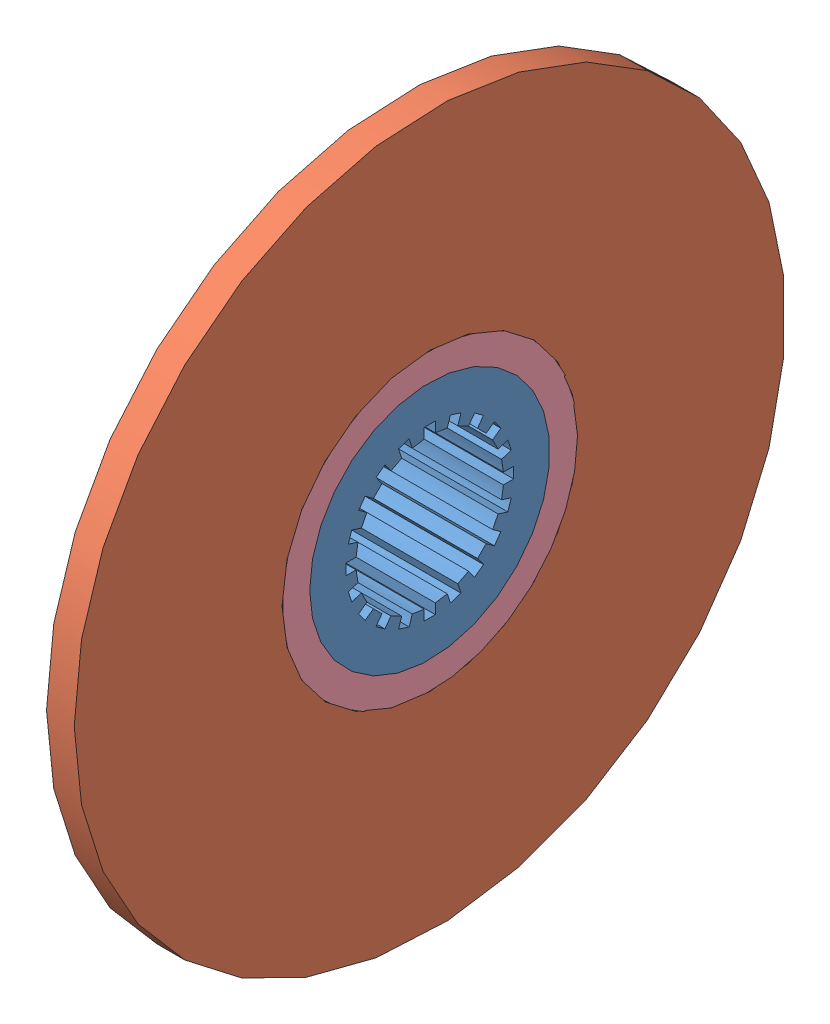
SolidWorks assembly 125 - disque embrayage.SLDASM, configuration Default (file format 3100). Lengths in mm.
Overall size (80 385 385).
4 component instances, 4 part files, 2 mates.
Components (placement in the parent):
- A - 125 - disque embrayage-1: A - 125 - disque embrayage.SLDPRT [Default] at (-15.2483 11.0028 0.5712) size (80 203.44 150)
- B - 125 - disque embrayage-1: B - 125 - disque embrayage.SLDPRT [Default] at (50.7517 11.0028 0.5712) size (17.5 385 385)
- bead1-1: bead1.sldprt [Défaut] at origin size (11.73 174.1 173.31)
- bead2-1: bead2.sldprt [Défaut] at origin size (7.5 160 160)
Mates (geometry in assembly coordinates):
- Coaxiale1: concentric aligned: cylinder of A - 125 - disque embrayage-1; cylinder of B - 125 - disque embrayage-1
- Coïncidente1: coincident anti-aligned: plane of A - 125 - disque embrayage-1 through (50.7517 83.5028 0.5712) normal (1 0 0); plane of B - 125 - disque embrayage-1 through (50.7517 83.5028 0.5712) normal (-1 0 0)
